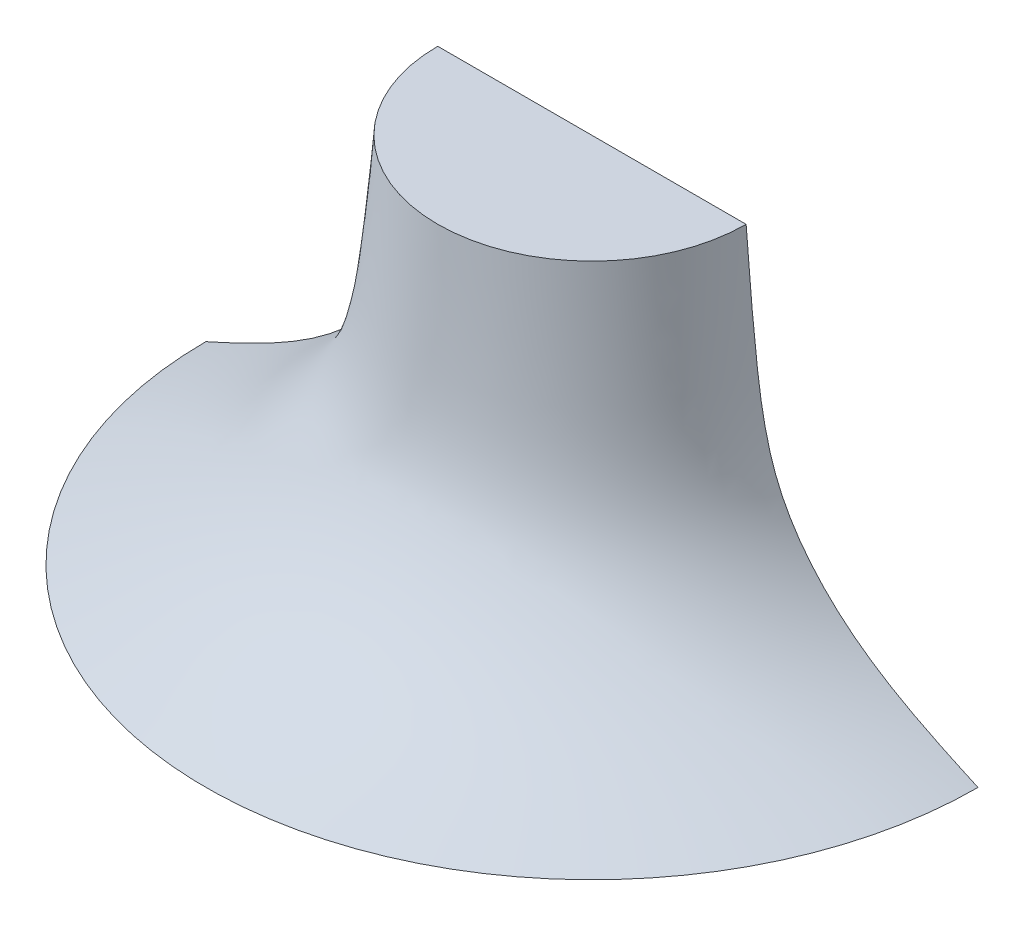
from build123d import *

# Parameters (mm, degrees)
REVOLVE1_ANGLE = 180


with BuildPart() as part:
    # Sketch1 → Revolve1 (revolve)
    with BuildSketch(Plane.XY):
        with BuildLine():
            Line((29.911986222, 48.51297088), (-6.719651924, 48.51297088))
            add(Edge.make_bspline(
                [(-6.719651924, 48.51297088), (-7.068856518, 44.147097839), (-7.79788536, 35.431712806), (-9.12681935, 22.295116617), (-10.678979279, 11.045219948), (-12.954361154, 2.191326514), (-15.369089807, -4.289247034), (-18.676652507, -10.436707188), (-24.049422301, -18.014179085), (-32.251605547, -26.349009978), (-43.413171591, -34.263483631), (-51.280517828, -38.492295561), (-55.292165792, -40.48702912)],
                knots=[0.162761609, 0.162761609, 0.162761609, 0.162761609, 0.25795474, 0.353147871, 0.448341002, 0.495937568, 0.543534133, 0.591130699, 0.638727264, 0.733920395, 0.829113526, 0.924306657, 0.924306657, 0.924306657, 0.924306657], degree=3))
            Line((-55.292165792, -40.48702912), (29.911986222, -40.48702912))
            Line((29.911986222, -40.48702912), (29.911986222, -43.48702912))
            Line((29.911986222, -43.48702912), (-68.747188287, -43.48702912))
            add(Edge.make_bspline(
                [(-68.747188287, -43.48702912), (-67.269434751, -42.816614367), (-55.729544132, -37.566826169), (-36.123527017, -27.711773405), (-15.876255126, -4.27934076), (-12.108398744, 21.429209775), (-10.418134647, 39.885486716), (-9.685979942, 49.040699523), (-9.490895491, 51.51297088)],
                knots=[0.066076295, 0.066076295, 0.066076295, 0.066076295, 0.101283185, 0.340833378, 0.539778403, 0.744207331, 0.890467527, 0.944397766, 0.944397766, 0.944397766, 0.944397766], degree=3))
            Line((-9.490895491, 51.51297088), (29.911986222, 51.51297088))
            Line((29.911986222, 51.51297088), (29.911986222, 48.51297088))
        make_face()
    revolve(axis=Axis((29.911986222, -43.48702912, 0), (0, 1, 0)), revolution_arc=REVOLVE1_ANGLE)


solid = part.part
